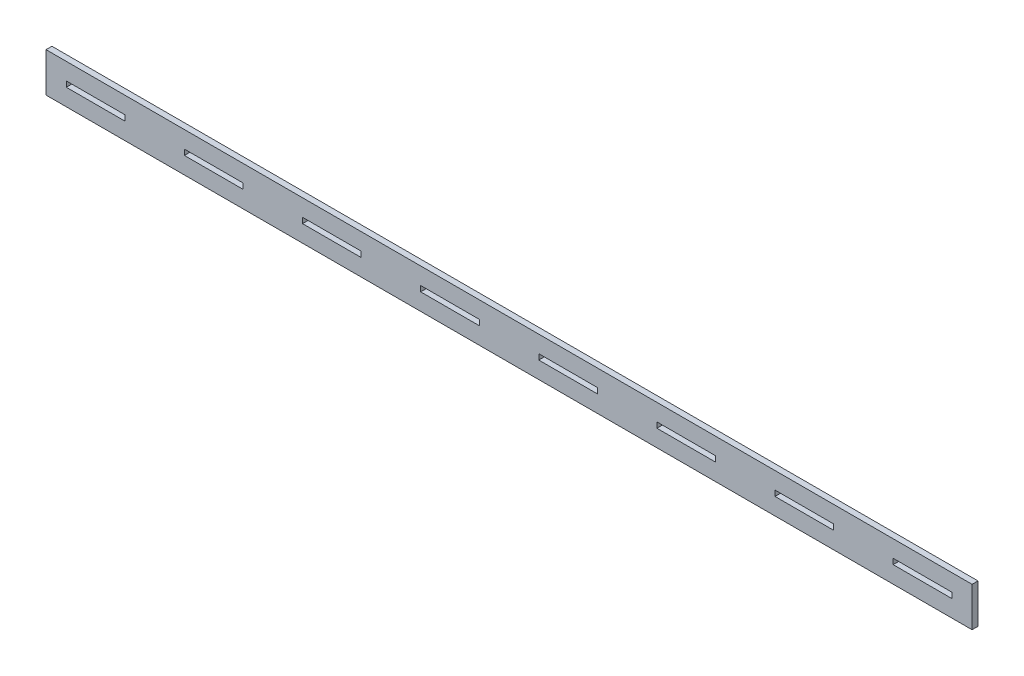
ISO-10303-21;
HEADER;
FILE_DESCRIPTION(('STEP AP214'),'2;1');
FILE_NAME('part.step','',(''),(''),'','','');
FILE_SCHEMA(('AUTOMOTIVE_DESIGN { 1 0 10303 214 1 1 1 1 }'));
ENDSEC;
DATA;
#1=APPLICATION_CONTEXT('core data for automotive mechanical design processes');
#2=APPLICATION_PROTOCOL_DEFINITION('international standard','automotive_design',2000,#1);
#3=PRODUCT_CONTEXT('',#1,'mechanical');
#4=PRODUCT('Part','Part','',(#3));
#5=PRODUCT_RELATED_PRODUCT_CATEGORY('part','',(#4));
#6=PRODUCT_DEFINITION_FORMATION('','',#4);
#7=PRODUCT_DEFINITION_CONTEXT('part definition',#1,'design');
#8=PRODUCT_DEFINITION('design','',#6,#7);
#9=PRODUCT_DEFINITION_SHAPE('','',#8);
#10=(LENGTH_UNIT() NAMED_UNIT(*) SI_UNIT(.MILLI.,.METRE.));
#11=(NAMED_UNIT(*) PLANE_ANGLE_UNIT() SI_UNIT($,.RADIAN.));
#12=(NAMED_UNIT(*) SI_UNIT($,.STERADIAN.) SOLID_ANGLE_UNIT());
#13=UNCERTAINTY_MEASURE_WITH_UNIT(LENGTH_MEASURE(1.E-05),#10,'distance_accuracy_value','');
#14=(GEOMETRIC_REPRESENTATION_CONTEXT(3) GLOBAL_UNCERTAINTY_ASSIGNED_CONTEXT((#13)) GLOBAL_UNIT_ASSIGNED_CONTEXT((#10,
#11,#12)) REPRESENTATION_CONTEXT('',''));
#15=CARTESIAN_POINT('',(0.,0.,0.));
#16=DIRECTION('',(0.,0.,1.));
#17=DIRECTION('',(1.,0.,0.));
#18=AXIS2_PLACEMENT_3D('',#15,#16,#17);
#19=CARTESIAN_POINT('',(0.,0.,3.));
#20=DIRECTION('',(0.,0.,-1.));
#21=DIRECTION('',(-1.,0.,0.));
#22=AXIS2_PLACEMENT_3D('',#19,#20,#21);
#23=PLANE('',#22);
#24=DIRECTION('',(0.,1.,0.));
#25=VECTOR('',#24,1.);
#26=CARTESIAN_POINT('',(164.9,-1.4,3.));
#27=LINE('',#26,#25);
#28=CARTESIAN_POINT('',(164.9,-1.4,3.));
#29=VERTEX_POINT('',#28);
#30=CARTESIAN_POINT('',(164.9,1.4,3.));
#31=VERTEX_POINT('',#30);
#32=EDGE_CURVE('E301',#29,#31,#27,.T.);
#33=ORIENTED_EDGE('',*,*,#32,.F.);
#34=DIRECTION('',(1.,0.,0.));
#35=VECTOR('',#34,1.);
#36=CARTESIAN_POINT('',(135.1,-1.4,3.));
#37=LINE('',#36,#35);
#38=CARTESIAN_POINT('',(135.1,-1.4,3.));
#39=VERTEX_POINT('',#38);
#40=EDGE_CURVE('E309',#39,#29,#37,.T.);
#41=ORIENTED_EDGE('',*,*,#40,.F.);
#42=DIRECTION('',(0.,-1.,0.));
#43=VECTOR('',#42,1.);
#44=CARTESIAN_POINT('',(135.1,-1.4,3.));
#45=LINE('',#44,#43);
#46=CARTESIAN_POINT('',(135.1,1.4,3.));
#47=VERTEX_POINT('',#46);
#48=EDGE_CURVE('E306',#47,#39,#45,.T.);
#49=ORIENTED_EDGE('',*,*,#48,.F.);
#50=DIRECTION('',(-1.,0.,0.));
#51=VECTOR('',#50,1.);
#52=CARTESIAN_POINT('',(135.1,1.4,3.));
#53=LINE('',#52,#51);
#54=EDGE_CURVE('E303',#31,#47,#53,.T.);
#55=ORIENTED_EDGE('',*,*,#54,.F.);
#56=EDGE_LOOP('',(#33,#41,#49,#55));
#57=FACE_BOUND('',#56,.T.);
#58=DIRECTION('',(0.,1.,0.));
#59=VECTOR('',#58,1.);
#60=CARTESIAN_POINT('',(44.9,-1.40000000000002,3.));
#61=LINE('',#60,#59);
#62=CARTESIAN_POINT('',(44.9,-1.40000000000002,3.));
#63=VERTEX_POINT('',#62);
#64=CARTESIAN_POINT('',(44.9,1.40000000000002,3.));
#65=VERTEX_POINT('',#64);
#66=EDGE_CURVE('E363',#63,#65,#61,.T.);
#67=ORIENTED_EDGE('',*,*,#66,.F.);
#68=DIRECTION('',(1.,0.,0.));
#69=VECTOR('',#68,1.);
#70=CARTESIAN_POINT('',(15.1,-1.40000000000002,3.));
#71=LINE('',#70,#69);
#72=CARTESIAN_POINT('',(15.1,-1.40000000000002,3.));
#73=VERTEX_POINT('',#72);
#74=EDGE_CURVE('E371',#73,#63,#71,.T.);
#75=ORIENTED_EDGE('',*,*,#74,.F.);
#76=DIRECTION('',(0.,-1.,0.));
#77=VECTOR('',#76,1.);
#78=CARTESIAN_POINT('',(15.1,-1.40000000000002,3.));
#79=LINE('',#78,#77);
#80=CARTESIAN_POINT('',(15.1,1.40000000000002,3.));
#81=VERTEX_POINT('',#80);
#82=EDGE_CURVE('E368',#81,#73,#79,.T.);
#83=ORIENTED_EDGE('',*,*,#82,.F.);
#84=DIRECTION('',(-1.,0.,0.));
#85=VECTOR('',#84,1.);
#86=CARTESIAN_POINT('',(15.1,1.40000000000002,3.));
#87=LINE('',#86,#85);
#88=EDGE_CURVE('E365',#65,#81,#87,.T.);
#89=ORIENTED_EDGE('',*,*,#88,.F.);
#90=EDGE_LOOP('',(#67,#75,#83,#89));
#91=FACE_BOUND('',#90,.T.);
#92=DIRECTION('',(0.,1.,0.));
#93=VECTOR('',#92,1.);
#94=CARTESIAN_POINT('',(-75.1,-1.4,3.));
#95=LINE('',#94,#93);
#96=CARTESIAN_POINT('',(-75.1,-1.4,3.));
#97=VERTEX_POINT('',#96);
#98=CARTESIAN_POINT('',(-75.1,1.4,3.));
#99=VERTEX_POINT('',#98);
#100=EDGE_CURVE('E425',#97,#99,#95,.T.);
#101=ORIENTED_EDGE('',*,*,#100,.F.);
#102=DIRECTION('',(1.,0.,0.));
#103=VECTOR('',#102,1.);
#104=CARTESIAN_POINT('',(-104.9,-1.4,3.));
#105=LINE('',#104,#103);
#106=CARTESIAN_POINT('',(-104.9,-1.4,3.));
#107=VERTEX_POINT('',#106);
#108=EDGE_CURVE('E433',#107,#97,#105,.T.);
#109=ORIENTED_EDGE('',*,*,#108,.F.);
#110=DIRECTION('',(0.,-1.,0.));
#111=VECTOR('',#110,1.);
#112=CARTESIAN_POINT('',(-104.9,-1.4,3.));
#113=LINE('',#112,#111);
#114=CARTESIAN_POINT('',(-104.9,1.4,3.));
#115=VERTEX_POINT('',#114);
#116=EDGE_CURVE('E430',#115,#107,#113,.T.);
#117=ORIENTED_EDGE('',*,*,#116,.F.);
#118=DIRECTION('',(-1.,0.,0.));
#119=VECTOR('',#118,1.);
#120=CARTESIAN_POINT('',(-104.9,1.4,3.));
#121=LINE('',#120,#119);
#122=EDGE_CURVE('E427',#99,#115,#121,.T.);
#123=ORIENTED_EDGE('',*,*,#122,.F.);
#124=EDGE_LOOP('',(#101,#109,#117,#123));
#125=FACE_BOUND('',#124,.T.);
#126=DIRECTION('',(0.,1.,0.));
#127=VECTOR('',#126,1.);
#128=CARTESIAN_POINT('',(-195.1,-1.4,3.));
#129=LINE('',#128,#127);
#130=CARTESIAN_POINT('',(-195.1,-1.4,3.));
#131=VERTEX_POINT('',#130);
#132=CARTESIAN_POINT('',(-195.1,1.4,3.));
#133=VERTEX_POINT('',#132);
#134=EDGE_CURVE('E487',#131,#133,#129,.T.);
#135=ORIENTED_EDGE('',*,*,#134,.F.);
#136=DIRECTION('',(1.,0.,0.));
#137=VECTOR('',#136,1.);
#138=CARTESIAN_POINT('',(-224.9,-1.4,3.));
#139=LINE('',#138,#137);
#140=CARTESIAN_POINT('',(-224.9,-1.4,3.));
#141=VERTEX_POINT('',#140);
#142=EDGE_CURVE('E495',#141,#131,#139,.T.);
#143=ORIENTED_EDGE('',*,*,#142,.F.);
#144=DIRECTION('',(0.,-1.,0.));
#145=VECTOR('',#144,1.);
#146=CARTESIAN_POINT('',(-224.9,-1.4,3.));
#147=LINE('',#146,#145);
#148=CARTESIAN_POINT('',(-224.9,1.4,3.));
#149=VERTEX_POINT('',#148);
#150=EDGE_CURVE('E492',#149,#141,#147,.T.);
#151=ORIENTED_EDGE('',*,*,#150,.F.);
#152=DIRECTION('',(-1.,0.,0.));
#153=VECTOR('',#152,1.);
#154=CARTESIAN_POINT('',(-224.9,1.4,3.));
#155=LINE('',#154,#153);
#156=EDGE_CURVE('E489',#133,#149,#155,.T.);
#157=ORIENTED_EDGE('',*,*,#156,.F.);
#158=EDGE_LOOP('',(#135,#143,#151,#157));
#159=FACE_BOUND('',#158,.T.);
#160=DIRECTION('',(0.,1.,0.));
#161=VECTOR('',#160,1.);
#162=CARTESIAN_POINT('',(235.2,-10.,3.));
#163=LINE('',#162,#161);
#164=CARTESIAN_POINT('',(235.2,-10.,3.));
#165=VERTEX_POINT('',#164);
#166=CARTESIAN_POINT('',(235.2,10.,3.));
#167=VERTEX_POINT('',#166);
#168=EDGE_CURVE('E518',#165,#167,#163,.T.);
#169=ORIENTED_EDGE('',*,*,#168,.T.);
#170=DIRECTION('',(-1.,0.,0.));
#171=VECTOR('',#170,1.);
#172=CARTESIAN_POINT('',(-235.2,10.,3.));
#173=LINE('',#172,#171);
#174=CARTESIAN_POINT('',(-235.2,10.,3.));
#175=VERTEX_POINT('',#174);
#176=EDGE_CURVE('E521',#167,#175,#173,.T.);
#177=ORIENTED_EDGE('',*,*,#176,.T.);
#178=DIRECTION('',(0.,-1.,0.));
#179=VECTOR('',#178,1.);
#180=CARTESIAN_POINT('',(-235.2,-10.,3.));
#181=LINE('',#180,#179);
#182=CARTESIAN_POINT('',(-235.2,-10.,3.));
#183=VERTEX_POINT('',#182);
#184=EDGE_CURVE('E524',#175,#183,#181,.T.);
#185=ORIENTED_EDGE('',*,*,#184,.T.);
#186=DIRECTION('',(1.,0.,0.));
#187=VECTOR('',#186,1.);
#188=CARTESIAN_POINT('',(-235.2,-10.,3.));
#189=LINE('',#188,#187);
#190=EDGE_CURVE('E526',#183,#165,#189,.T.);
#191=ORIENTED_EDGE('',*,*,#190,.T.);
#192=EDGE_LOOP('',(#169,#177,#185,#191));
#193=FACE_BOUND('',#192,.T.);
#194=DIRECTION('',(0.,1.,0.));
#195=VECTOR('',#194,1.);
#196=CARTESIAN_POINT('',(-15.1,-1.4,3.));
#197=LINE('',#196,#195);
#198=CARTESIAN_POINT('',(-15.1,-1.4,3.));
#199=VERTEX_POINT('',#198);
#200=CARTESIAN_POINT('',(-15.1,1.4,3.));
#201=VERTEX_POINT('',#200);
#202=EDGE_CURVE('E456',#199,#201,#197,.T.);
#203=ORIENTED_EDGE('',*,*,#202,.F.);
#204=DIRECTION('',(1.,0.,0.));
#205=VECTOR('',#204,1.);
#206=CARTESIAN_POINT('',(-44.9,-1.4,3.));
#207=LINE('',#206,#205);
#208=CARTESIAN_POINT('',(-44.9,-1.4,3.));
#209=VERTEX_POINT('',#208);
#210=EDGE_CURVE('E464',#209,#199,#207,.T.);
#211=ORIENTED_EDGE('',*,*,#210,.F.);
#212=DIRECTION('',(0.,-1.,0.));
#213=VECTOR('',#212,1.);
#214=CARTESIAN_POINT('',(-44.9,-1.4,3.));
#215=LINE('',#214,#213);
#216=CARTESIAN_POINT('',(-44.9,1.4,3.));
#217=VERTEX_POINT('',#216);
#218=EDGE_CURVE('E461',#217,#209,#215,.T.);
#219=ORIENTED_EDGE('',*,*,#218,.F.);
#220=DIRECTION('',(-1.,0.,0.));
#221=VECTOR('',#220,1.);
#222=CARTESIAN_POINT('',(-44.9,1.4,3.));
#223=LINE('',#222,#221);
#224=EDGE_CURVE('E458',#201,#217,#223,.T.);
#225=ORIENTED_EDGE('',*,*,#224,.F.);
#226=EDGE_LOOP('',(#203,#211,#219,#225));
#227=FACE_BOUND('',#226,.T.);
#228=DIRECTION('',(0.,1.,0.));
#229=VECTOR('',#228,1.);
#230=CARTESIAN_POINT('',(-135.1,-1.4,3.));
#231=LINE('',#230,#229);
#232=CARTESIAN_POINT('',(-135.1,-1.4,3.));
#233=VERTEX_POINT('',#232);
#234=CARTESIAN_POINT('',(-135.1,1.4,3.));
#235=VERTEX_POINT('',#234);
#236=EDGE_CURVE('E394',#233,#235,#231,.T.);
#237=ORIENTED_EDGE('',*,*,#236,.F.);
#238=DIRECTION('',(1.,0.,0.));
#239=VECTOR('',#238,1.);
#240=CARTESIAN_POINT('',(-164.9,-1.4,3.));
#241=LINE('',#240,#239);
#242=CARTESIAN_POINT('',(-164.9,-1.4,3.));
#243=VERTEX_POINT('',#242);
#244=EDGE_CURVE('E402',#243,#233,#241,.T.);
#245=ORIENTED_EDGE('',*,*,#244,.F.);
#246=DIRECTION('',(0.,-1.,0.));
#247=VECTOR('',#246,1.);
#248=CARTESIAN_POINT('',(-164.9,-1.4,3.));
#249=LINE('',#248,#247);
#250=CARTESIAN_POINT('',(-164.9,1.4,3.));
#251=VERTEX_POINT('',#250);
#252=EDGE_CURVE('E399',#251,#243,#249,.T.);
#253=ORIENTED_EDGE('',*,*,#252,.F.);
#254=DIRECTION('',(-1.,0.,0.));
#255=VECTOR('',#254,1.);
#256=CARTESIAN_POINT('',(-164.9,1.4,3.));
#257=LINE('',#256,#255);
#258=EDGE_CURVE('E396',#235,#251,#257,.T.);
#259=ORIENTED_EDGE('',*,*,#258,.F.);
#260=EDGE_LOOP('',(#237,#245,#253,#259));
#261=FACE_BOUND('',#260,.T.);
#262=DIRECTION('',(0.,1.,0.));
#263=VECTOR('',#262,1.);
#264=CARTESIAN_POINT('',(104.9,-1.40000000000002,3.));
#265=LINE('',#264,#263);
#266=CARTESIAN_POINT('',(104.9,-1.40000000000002,3.));
#267=VERTEX_POINT('',#266);
#268=CARTESIAN_POINT('',(104.9,1.40000000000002,3.));
#269=VERTEX_POINT('',#268);
#270=EDGE_CURVE('E332',#267,#269,#265,.T.);
#271=ORIENTED_EDGE('',*,*,#270,.F.);
#272=DIRECTION('',(1.,0.,0.));
#273=VECTOR('',#272,1.);
#274=CARTESIAN_POINT('',(75.1,-1.40000000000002,3.));
#275=LINE('',#274,#273);
#276=CARTESIAN_POINT('',(75.1,-1.40000000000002,3.));
#277=VERTEX_POINT('',#276);
#278=EDGE_CURVE('E340',#277,#267,#275,.T.);
#279=ORIENTED_EDGE('',*,*,#278,.F.);
#280=DIRECTION('',(0.,-1.,0.));
#281=VECTOR('',#280,1.);
#282=CARTESIAN_POINT('',(75.1,-1.40000000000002,3.));
#283=LINE('',#282,#281);
#284=CARTESIAN_POINT('',(75.1,1.40000000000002,3.));
#285=VERTEX_POINT('',#284);
#286=EDGE_CURVE('E337',#285,#277,#283,.T.);
#287=ORIENTED_EDGE('',*,*,#286,.F.);
#288=DIRECTION('',(-1.,0.,0.));
#289=VECTOR('',#288,1.);
#290=CARTESIAN_POINT('',(75.1,1.40000000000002,3.));
#291=LINE('',#290,#289);
#292=EDGE_CURVE('E334',#269,#285,#291,.T.);
#293=ORIENTED_EDGE('',*,*,#292,.F.);
#294=EDGE_LOOP('',(#271,#279,#287,#293));
#295=FACE_BOUND('',#294,.T.);
#296=DIRECTION('',(0.,1.,0.));
#297=VECTOR('',#296,1.);
#298=CARTESIAN_POINT('',(224.9,-1.4,3.));
#299=LINE('',#298,#297);
#300=CARTESIAN_POINT('',(224.9,-1.4,3.));
#301=VERTEX_POINT('',#300);
#302=CARTESIAN_POINT('',(224.9,1.4,3.));
#303=VERTEX_POINT('',#302);
#304=EDGE_CURVE('E265',#301,#303,#299,.T.);
#305=ORIENTED_EDGE('',*,*,#304,.F.);
#306=DIRECTION('',(1.,0.,0.));
#307=VECTOR('',#306,1.);
#308=CARTESIAN_POINT('',(195.1,-1.4,3.));
#309=LINE('',#308,#307);
#310=CARTESIAN_POINT('',(195.1,-1.4,3.));
#311=VERTEX_POINT('',#310);
#312=EDGE_CURVE('E287',#311,#301,#309,.T.);
#313=ORIENTED_EDGE('',*,*,#312,.F.);
#314=DIRECTION('',(0.,-1.,0.));
#315=VECTOR('',#314,1.);
#316=CARTESIAN_POINT('',(195.1,-1.4,3.));
#317=LINE('',#316,#315);
#318=CARTESIAN_POINT('',(195.1,1.4,3.));
#319=VERTEX_POINT('',#318);
#320=EDGE_CURVE('E285',#319,#311,#317,.T.);
#321=ORIENTED_EDGE('',*,*,#320,.F.);
#322=DIRECTION('',(-1.,0.,0.));
#323=VECTOR('',#322,1.);
#324=CARTESIAN_POINT('',(195.1,1.4,3.));
#325=LINE('',#324,#323);
#326=EDGE_CURVE('E273',#303,#319,#325,.T.);
#327=ORIENTED_EDGE('',*,*,#326,.F.);
#328=EDGE_LOOP('',(#305,#313,#321,#327));
#329=FACE_BOUND('',#328,.T.);
#330=ADVANCED_FACE('F32',(#57,#91,#125,#159,#193,#227,#261,#295,#329),#23,.F.);
#331=CARTESIAN_POINT('',(0.,0.,0.));
#332=DIRECTION('',(0.,0.,-1.));
#333=DIRECTION('',(-1.,0.,0.));
#334=AXIS2_PLACEMENT_3D('',#331,#332,#333);
#335=PLANE('',#334);
#336=DIRECTION('',(0.,1.,0.));
#337=VECTOR('',#336,1.);
#338=CARTESIAN_POINT('',(235.2,-10.,0.));
#339=LINE('',#338,#337);
#340=CARTESIAN_POINT('',(235.2,-10.,0.));
#341=VERTEX_POINT('',#340);
#342=CARTESIAN_POINT('',(235.2,10.,0.));
#343=VERTEX_POINT('',#342);
#344=EDGE_CURVE('E517',#341,#343,#339,.T.);
#345=ORIENTED_EDGE('',*,*,#344,.F.);
#346=DIRECTION('',(1.,0.,0.));
#347=VECTOR('',#346,1.);
#348=CARTESIAN_POINT('',(-235.2,-10.,0.));
#349=LINE('',#348,#347);
#350=CARTESIAN_POINT('',(-235.2,-10.,0.));
#351=VERTEX_POINT('',#350);
#352=EDGE_CURVE('E522',#351,#341,#349,.T.);
#353=ORIENTED_EDGE('',*,*,#352,.F.);
#354=DIRECTION('',(0.,-1.,0.));
#355=VECTOR('',#354,1.);
#356=CARTESIAN_POINT('',(-235.2,-10.,0.));
#357=LINE('',#356,#355);
#358=CARTESIAN_POINT('',(-235.2,10.,0.));
#359=VERTEX_POINT('',#358);
#360=EDGE_CURVE('E533',#359,#351,#357,.T.);
#361=ORIENTED_EDGE('',*,*,#360,.F.);
#362=DIRECTION('',(-1.,0.,0.));
#363=VECTOR('',#362,1.);
#364=CARTESIAN_POINT('',(-235.2,10.,0.));
#365=LINE('',#364,#363);
#366=EDGE_CURVE('E531',#343,#359,#365,.T.);
#367=ORIENTED_EDGE('',*,*,#366,.F.);
#368=EDGE_LOOP('',(#345,#353,#361,#367));
#369=FACE_BOUND('',#368,.T.);
#370=DIRECTION('',(1.,0.,0.));
#371=VECTOR('',#370,1.);
#372=CARTESIAN_POINT('',(-224.9,-1.4,0.));
#373=LINE('',#372,#371);
#374=CARTESIAN_POINT('',(-224.9,-1.4,0.));
#375=VERTEX_POINT('',#374);
#376=CARTESIAN_POINT('',(-195.1,-1.4,0.));
#377=VERTEX_POINT('',#376);
#378=EDGE_CURVE('E490',#375,#377,#373,.T.);
#379=ORIENTED_EDGE('',*,*,#378,.T.);
#380=DIRECTION('',(0.,1.,0.));
#381=VECTOR('',#380,1.);
#382=CARTESIAN_POINT('',(-195.1,-1.4,0.));
#383=LINE('',#382,#381);
#384=CARTESIAN_POINT('',(-195.1,1.4,0.));
#385=VERTEX_POINT('',#384);
#386=EDGE_CURVE('E486',#377,#385,#383,.T.);
#387=ORIENTED_EDGE('',*,*,#386,.T.);
#388=DIRECTION('',(-1.,0.,0.));
#389=VECTOR('',#388,1.);
#390=CARTESIAN_POINT('',(-224.9,1.4,0.));
#391=LINE('',#390,#389);
#392=CARTESIAN_POINT('',(-224.9,1.4,0.));
#393=VERTEX_POINT('',#392);
#394=EDGE_CURVE('E500',#385,#393,#391,.T.);
#395=ORIENTED_EDGE('',*,*,#394,.T.);
#396=DIRECTION('',(0.,-1.,0.));
#397=VECTOR('',#396,1.);
#398=CARTESIAN_POINT('',(-224.9,-1.4,0.));
#399=LINE('',#398,#397);
#400=EDGE_CURVE('E503',#393,#375,#399,.T.);
#401=ORIENTED_EDGE('',*,*,#400,.T.);
#402=EDGE_LOOP('',(#379,#387,#395,#401));
#403=FACE_BOUND('',#402,.T.);
#404=DIRECTION('',(1.,0.,0.));
#405=VECTOR('',#404,1.);
#406=CARTESIAN_POINT('',(-44.9,-1.4,0.));
#407=LINE('',#406,#405);
#408=CARTESIAN_POINT('',(-44.9,-1.4,0.));
#409=VERTEX_POINT('',#408);
#410=CARTESIAN_POINT('',(-15.1,-1.4,0.));
#411=VERTEX_POINT('',#410);
#412=EDGE_CURVE('E459',#409,#411,#407,.T.);
#413=ORIENTED_EDGE('',*,*,#412,.T.);
#414=DIRECTION('',(0.,1.,0.));
#415=VECTOR('',#414,1.);
#416=CARTESIAN_POINT('',(-15.1,-1.4,0.));
#417=LINE('',#416,#415);
#418=CARTESIAN_POINT('',(-15.1,1.4,0.));
#419=VERTEX_POINT('',#418);
#420=EDGE_CURVE('E455',#411,#419,#417,.T.);
#421=ORIENTED_EDGE('',*,*,#420,.T.);
#422=DIRECTION('',(-1.,0.,0.));
#423=VECTOR('',#422,1.);
#424=CARTESIAN_POINT('',(-44.9,1.4,0.));
#425=LINE('',#424,#423);
#426=CARTESIAN_POINT('',(-44.9,1.4,0.));
#427=VERTEX_POINT('',#426);
#428=EDGE_CURVE('E469',#419,#427,#425,.T.);
#429=ORIENTED_EDGE('',*,*,#428,.T.);
#430=DIRECTION('',(0.,-1.,0.));
#431=VECTOR('',#430,1.);
#432=CARTESIAN_POINT('',(-44.9,-1.4,0.));
#433=LINE('',#432,#431);
#434=EDGE_CURVE('E472',#427,#409,#433,.T.);
#435=ORIENTED_EDGE('',*,*,#434,.T.);
#436=EDGE_LOOP('',(#413,#421,#429,#435));
#437=FACE_BOUND('',#436,.T.);
#438=DIRECTION('',(1.,0.,0.));
#439=VECTOR('',#438,1.);
#440=CARTESIAN_POINT('',(-104.9,-1.4,0.));
#441=LINE('',#440,#439);
#442=CARTESIAN_POINT('',(-104.9,-1.4,0.));
#443=VERTEX_POINT('',#442);
#444=CARTESIAN_POINT('',(-75.1,-1.4,0.));
#445=VERTEX_POINT('',#444);
#446=EDGE_CURVE('E428',#443,#445,#441,.T.);
#447=ORIENTED_EDGE('',*,*,#446,.T.);
#448=DIRECTION('',(0.,1.,0.));
#449=VECTOR('',#448,1.);
#450=CARTESIAN_POINT('',(-75.1,-1.4,0.));
#451=LINE('',#450,#449);
#452=CARTESIAN_POINT('',(-75.1,1.4,0.));
#453=VERTEX_POINT('',#452);
#454=EDGE_CURVE('E424',#445,#453,#451,.T.);
#455=ORIENTED_EDGE('',*,*,#454,.T.);
#456=DIRECTION('',(-1.,0.,0.));
#457=VECTOR('',#456,1.);
#458=CARTESIAN_POINT('',(-104.9,1.4,0.));
#459=LINE('',#458,#457);
#460=CARTESIAN_POINT('',(-104.9,1.4,0.));
#461=VERTEX_POINT('',#460);
#462=EDGE_CURVE('E438',#453,#461,#459,.T.);
#463=ORIENTED_EDGE('',*,*,#462,.T.);
#464=DIRECTION('',(0.,-1.,0.));
#465=VECTOR('',#464,1.);
#466=CARTESIAN_POINT('',(-104.9,-1.4,0.));
#467=LINE('',#466,#465);
#468=EDGE_CURVE('E441',#461,#443,#467,.T.);
#469=ORIENTED_EDGE('',*,*,#468,.T.);
#470=EDGE_LOOP('',(#447,#455,#463,#469));
#471=FACE_BOUND('',#470,.T.);
#472=DIRECTION('',(1.,0.,0.));
#473=VECTOR('',#472,1.);
#474=CARTESIAN_POINT('',(-164.9,-1.4,0.));
#475=LINE('',#474,#473);
#476=CARTESIAN_POINT('',(-164.9,-1.4,0.));
#477=VERTEX_POINT('',#476);
#478=CARTESIAN_POINT('',(-135.1,-1.4,0.));
#479=VERTEX_POINT('',#478);
#480=EDGE_CURVE('E397',#477,#479,#475,.T.);
#481=ORIENTED_EDGE('',*,*,#480,.T.);
#482=DIRECTION('',(0.,1.,0.));
#483=VECTOR('',#482,1.);
#484=CARTESIAN_POINT('',(-135.1,-1.4,0.));
#485=LINE('',#484,#483);
#486=CARTESIAN_POINT('',(-135.1,1.4,0.));
#487=VERTEX_POINT('',#486);
#488=EDGE_CURVE('E393',#479,#487,#485,.T.);
#489=ORIENTED_EDGE('',*,*,#488,.T.);
#490=DIRECTION('',(-1.,0.,0.));
#491=VECTOR('',#490,1.);
#492=CARTESIAN_POINT('',(-164.9,1.4,0.));
#493=LINE('',#492,#491);
#494=CARTESIAN_POINT('',(-164.9,1.4,0.));
#495=VERTEX_POINT('',#494);
#496=EDGE_CURVE('E407',#487,#495,#493,.T.);
#497=ORIENTED_EDGE('',*,*,#496,.T.);
#498=DIRECTION('',(0.,-1.,0.));
#499=VECTOR('',#498,1.);
#500=CARTESIAN_POINT('',(-164.9,-1.4,0.));
#501=LINE('',#500,#499);
#502=EDGE_CURVE('E410',#495,#477,#501,.T.);
#503=ORIENTED_EDGE('',*,*,#502,.T.);
#504=EDGE_LOOP('',(#481,#489,#497,#503));
#505=FACE_BOUND('',#504,.T.);
#506=DIRECTION('',(1.,0.,0.));
#507=VECTOR('',#506,1.);
#508=CARTESIAN_POINT('',(15.1,-1.40000000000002,0.));
#509=LINE('',#508,#507);
#510=CARTESIAN_POINT('',(15.1,-1.40000000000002,0.));
#511=VERTEX_POINT('',#510);
#512=CARTESIAN_POINT('',(44.9,-1.40000000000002,0.));
#513=VERTEX_POINT('',#512);
#514=EDGE_CURVE('E366',#511,#513,#509,.T.);
#515=ORIENTED_EDGE('',*,*,#514,.T.);
#516=DIRECTION('',(0.,1.,0.));
#517=VECTOR('',#516,1.);
#518=CARTESIAN_POINT('',(44.9,-1.40000000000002,0.));
#519=LINE('',#518,#517);
#520=CARTESIAN_POINT('',(44.9,1.40000000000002,0.));
#521=VERTEX_POINT('',#520);
#522=EDGE_CURVE('E362',#513,#521,#519,.T.);
#523=ORIENTED_EDGE('',*,*,#522,.T.);
#524=DIRECTION('',(-1.,0.,0.));
#525=VECTOR('',#524,1.);
#526=CARTESIAN_POINT('',(15.1,1.40000000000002,0.));
#527=LINE('',#526,#525);
#528=CARTESIAN_POINT('',(15.1,1.40000000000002,0.));
#529=VERTEX_POINT('',#528);
#530=EDGE_CURVE('E376',#521,#529,#527,.T.);
#531=ORIENTED_EDGE('',*,*,#530,.T.);
#532=DIRECTION('',(0.,-1.,0.));
#533=VECTOR('',#532,1.);
#534=CARTESIAN_POINT('',(15.1,-1.40000000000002,0.));
#535=LINE('',#534,#533);
#536=EDGE_CURVE('E379',#529,#511,#535,.T.);
#537=ORIENTED_EDGE('',*,*,#536,.T.);
#538=EDGE_LOOP('',(#515,#523,#531,#537));
#539=FACE_BOUND('',#538,.T.);
#540=DIRECTION('',(1.,0.,0.));
#541=VECTOR('',#540,1.);
#542=CARTESIAN_POINT('',(75.1,-1.40000000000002,0.));
#543=LINE('',#542,#541);
#544=CARTESIAN_POINT('',(75.1,-1.40000000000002,0.));
#545=VERTEX_POINT('',#544);
#546=CARTESIAN_POINT('',(104.9,-1.40000000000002,0.));
#547=VERTEX_POINT('',#546);
#548=EDGE_CURVE('E335',#545,#547,#543,.T.);
#549=ORIENTED_EDGE('',*,*,#548,.T.);
#550=DIRECTION('',(0.,1.,0.));
#551=VECTOR('',#550,1.);
#552=CARTESIAN_POINT('',(104.9,-1.40000000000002,0.));
#553=LINE('',#552,#551);
#554=CARTESIAN_POINT('',(104.9,1.40000000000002,0.));
#555=VERTEX_POINT('',#554);
#556=EDGE_CURVE('E331',#547,#555,#553,.T.);
#557=ORIENTED_EDGE('',*,*,#556,.T.);
#558=DIRECTION('',(-1.,0.,0.));
#559=VECTOR('',#558,1.);
#560=CARTESIAN_POINT('',(75.1,1.40000000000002,0.));
#561=LINE('',#560,#559);
#562=CARTESIAN_POINT('',(75.1,1.40000000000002,0.));
#563=VERTEX_POINT('',#562);
#564=EDGE_CURVE('E345',#555,#563,#561,.T.);
#565=ORIENTED_EDGE('',*,*,#564,.T.);
#566=DIRECTION('',(0.,-1.,0.));
#567=VECTOR('',#566,1.);
#568=CARTESIAN_POINT('',(75.1,-1.40000000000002,0.));
#569=LINE('',#568,#567);
#570=EDGE_CURVE('E348',#563,#545,#569,.T.);
#571=ORIENTED_EDGE('',*,*,#570,.T.);
#572=EDGE_LOOP('',(#549,#557,#565,#571));
#573=FACE_BOUND('',#572,.T.);
#574=DIRECTION('',(1.,0.,0.));
#575=VECTOR('',#574,1.);
#576=CARTESIAN_POINT('',(135.1,-1.4,0.));
#577=LINE('',#576,#575);
#578=CARTESIAN_POINT('',(135.1,-1.4,0.));
#579=VERTEX_POINT('',#578);
#580=CARTESIAN_POINT('',(164.9,-1.4,0.));
#581=VERTEX_POINT('',#580);
#582=EDGE_CURVE('E304',#579,#581,#577,.T.);
#583=ORIENTED_EDGE('',*,*,#582,.T.);
#584=DIRECTION('',(0.,1.,0.));
#585=VECTOR('',#584,1.);
#586=CARTESIAN_POINT('',(164.9,-1.4,0.));
#587=LINE('',#586,#585);
#588=CARTESIAN_POINT('',(164.9,1.4,0.));
#589=VERTEX_POINT('',#588);
#590=EDGE_CURVE('E281',#581,#589,#587,.T.);
#591=ORIENTED_EDGE('',*,*,#590,.T.);
#592=DIRECTION('',(-1.,0.,0.));
#593=VECTOR('',#592,1.);
#594=CARTESIAN_POINT('',(135.1,1.4,0.));
#595=LINE('',#594,#593);
#596=CARTESIAN_POINT('',(135.1,1.4,0.));
#597=VERTEX_POINT('',#596);
#598=EDGE_CURVE('E314',#589,#597,#595,.T.);
#599=ORIENTED_EDGE('',*,*,#598,.T.);
#600=DIRECTION('',(0.,-1.,0.));
#601=VECTOR('',#600,1.);
#602=CARTESIAN_POINT('',(135.1,-1.4,0.));
#603=LINE('',#602,#601);
#604=EDGE_CURVE('E317',#597,#579,#603,.T.);
#605=ORIENTED_EDGE('',*,*,#604,.T.);
#606=EDGE_LOOP('',(#583,#591,#599,#605));
#607=FACE_BOUND('',#606,.T.);
#608=DIRECTION('',(1.,0.,0.));
#609=VECTOR('',#608,1.);
#610=CARTESIAN_POINT('',(195.1,-1.4,0.));
#611=LINE('',#610,#609);
#612=CARTESIAN_POINT('',(195.1,-1.4,0.));
#613=VERTEX_POINT('',#612);
#614=CARTESIAN_POINT('',(224.9,-1.4,0.));
#615=VERTEX_POINT('',#614);
#616=EDGE_CURVE('E274',#613,#615,#611,.T.);
#617=ORIENTED_EDGE('',*,*,#616,.T.);
#618=DIRECTION('',(0.,1.,0.));
#619=VECTOR('',#618,1.);
#620=CARTESIAN_POINT('',(224.9,-1.4,0.));
#621=LINE('',#620,#619);
#622=CARTESIAN_POINT('',(224.9,1.4,0.));
#623=VERTEX_POINT('',#622);
#624=EDGE_CURVE('E55',#615,#623,#621,.T.);
#625=ORIENTED_EDGE('',*,*,#624,.T.);
#626=DIRECTION('',(-1.,0.,0.));
#627=VECTOR('',#626,1.);
#628=CARTESIAN_POINT('',(195.1,1.4,0.));
#629=LINE('',#628,#627);
#630=CARTESIAN_POINT('',(195.1,1.4,0.));
#631=VERTEX_POINT('',#630);
#632=EDGE_CURVE('E280',#623,#631,#629,.T.);
#633=ORIENTED_EDGE('',*,*,#632,.T.);
#634=DIRECTION('',(0.,-1.,0.));
#635=VECTOR('',#634,1.);
#636=CARTESIAN_POINT('',(195.1,-1.4,0.));
#637=LINE('',#636,#635);
#638=EDGE_CURVE('E293',#631,#613,#637,.T.);
#639=ORIENTED_EDGE('',*,*,#638,.T.);
#640=EDGE_LOOP('',(#617,#625,#633,#639));
#641=FACE_BOUND('',#640,.T.);
#642=ADVANCED_FACE('F551',(#369,#403,#437,#471,#505,#539,#573,#607,#641),#335,.T.);
#643=CARTESIAN_POINT('',(235.2,-10.,3.));
#644=DIRECTION('',(-1.,0.,0.));
#645=DIRECTION('',(0.,0.,1.));
#646=AXIS2_PLACEMENT_3D('',#643,#644,#645);
#647=PLANE('',#646);
#648=ORIENTED_EDGE('',*,*,#344,.T.);
#649=DIRECTION('',(0.,0.,-1.));
#650=VECTOR('',#649,1.);
#651=CARTESIAN_POINT('',(235.2,10.,3.));
#652=LINE('',#651,#650);
#653=EDGE_CURVE('E11',#167,#343,#652,.T.);
#654=ORIENTED_EDGE('',*,*,#653,.F.);
#655=ORIENTED_EDGE('',*,*,#168,.F.);
#656=DIRECTION('',(0.,0.,-1.));
#657=VECTOR('',#656,1.);
#658=CARTESIAN_POINT('',(235.2,-10.,3.));
#659=LINE('',#658,#657);
#660=EDGE_CURVE('E528',#165,#341,#659,.T.);
#661=ORIENTED_EDGE('',*,*,#660,.T.);
#662=EDGE_LOOP('',(#648,#654,#655,#661));
#663=FACE_BOUND('',#662,.T.);
#664=ADVANCED_FACE('F34',(#663),#647,.F.);
#665=CARTESIAN_POINT('',(-235.2,10.,3.));
#666=DIRECTION('',(0.,-1.,0.));
#667=DIRECTION('',(0.,0.,-1.));
#668=AXIS2_PLACEMENT_3D('',#665,#666,#667);
#669=PLANE('',#668);
#670=ORIENTED_EDGE('',*,*,#366,.T.);
#671=DIRECTION('',(0.,0.,-1.));
#672=VECTOR('',#671,1.);
#673=CARTESIAN_POINT('',(-235.2,10.,3.));
#674=LINE('',#673,#672);
#675=EDGE_CURVE('E40',#175,#359,#674,.T.);
#676=ORIENTED_EDGE('',*,*,#675,.F.);
#677=ORIENTED_EDGE('',*,*,#176,.F.);
#678=ORIENTED_EDGE('',*,*,#653,.T.);
#679=EDGE_LOOP('',(#670,#676,#677,#678));
#680=FACE_BOUND('',#679,.T.);
#681=ADVANCED_FACE('F562',(#680),#669,.F.);
#682=CARTESIAN_POINT('',(-235.2,-10.,3.));
#683=DIRECTION('',(1.,0.,0.));
#684=DIRECTION('',(0.,0.,-1.));
#685=AXIS2_PLACEMENT_3D('',#682,#683,#684);
#686=PLANE('',#685);
#687=ORIENTED_EDGE('',*,*,#360,.T.);
#688=DIRECTION('',(0.,0.,-1.));
#689=VECTOR('',#688,1.);
#690=CARTESIAN_POINT('',(-235.2,-10.,3.));
#691=LINE('',#690,#689);
#692=EDGE_CURVE('E538',#183,#351,#691,.T.);
#693=ORIENTED_EDGE('',*,*,#692,.F.);
#694=ORIENTED_EDGE('',*,*,#184,.F.);
#695=ORIENTED_EDGE('',*,*,#675,.T.);
#696=EDGE_LOOP('',(#687,#693,#694,#695));
#697=FACE_BOUND('',#696,.T.);
#698=ADVANCED_FACE('F545',(#697),#686,.F.);
#699=CARTESIAN_POINT('',(-235.2,-10.,3.));
#700=DIRECTION('',(0.,1.,0.));
#701=DIRECTION('',(0.,0.,1.));
#702=AXIS2_PLACEMENT_3D('',#699,#700,#701);
#703=PLANE('',#702);
#704=ORIENTED_EDGE('',*,*,#352,.T.);
#705=ORIENTED_EDGE('',*,*,#660,.F.);
#706=ORIENTED_EDGE('',*,*,#190,.F.);
#707=ORIENTED_EDGE('',*,*,#692,.T.);
#708=EDGE_LOOP('',(#704,#705,#706,#707));
#709=FACE_BOUND('',#708,.T.);
#710=ADVANCED_FACE('F555',(#709),#703,.F.);
#711=CARTESIAN_POINT('',(-195.1,-1.4,3.));
#712=DIRECTION('',(-1.,0.,0.));
#713=DIRECTION('',(0.,0.,1.));
#714=AXIS2_PLACEMENT_3D('',#711,#712,#713);
#715=PLANE('',#714);
#716=ORIENTED_EDGE('',*,*,#386,.F.);
#717=DIRECTION('',(0.,0.,-1.));
#718=VECTOR('',#717,1.);
#719=CARTESIAN_POINT('',(-195.1,-1.4,3.));
#720=LINE('',#719,#718);
#721=EDGE_CURVE('E497',#131,#377,#720,.T.);
#722=ORIENTED_EDGE('',*,*,#721,.F.);
#723=ORIENTED_EDGE('',*,*,#134,.T.);
#724=DIRECTION('',(0.,0.,-1.));
#725=VECTOR('',#724,1.);
#726=CARTESIAN_POINT('',(-195.1,1.4,3.));
#727=LINE('',#726,#725);
#728=EDGE_CURVE('E514',#133,#385,#727,.T.);
#729=ORIENTED_EDGE('',*,*,#728,.T.);
#730=EDGE_LOOP('',(#716,#722,#723,#729));
#731=FACE_BOUND('',#730,.T.);
#732=ADVANCED_FACE('F579',(#731),#715,.T.);
#733=CARTESIAN_POINT('',(-224.9,1.4,3.));
#734=DIRECTION('',(0.,-1.,0.));
#735=DIRECTION('',(1.,0.,0.));
#736=AXIS2_PLACEMENT_3D('',#733,#734,#735);
#737=PLANE('',#736);
#738=ORIENTED_EDGE('',*,*,#394,.F.);
#739=ORIENTED_EDGE('',*,*,#728,.F.);
#740=ORIENTED_EDGE('',*,*,#156,.T.);
#741=DIRECTION('',(0.,0.,-1.));
#742=VECTOR('',#741,1.);
#743=CARTESIAN_POINT('',(-224.9,1.4,3.));
#744=LINE('',#743,#742);
#745=EDGE_CURVE('E512',#149,#393,#744,.T.);
#746=ORIENTED_EDGE('',*,*,#745,.T.);
#747=EDGE_LOOP('',(#738,#739,#740,#746));
#748=FACE_BOUND('',#747,.T.);
#749=ADVANCED_FACE('F586',(#748),#737,.T.);
#750=CARTESIAN_POINT('',(-224.9,-1.4,3.));
#751=DIRECTION('',(1.,0.,0.));
#752=DIRECTION('',(0.,0.,-1.));
#753=AXIS2_PLACEMENT_3D('',#750,#751,#752);
#754=PLANE('',#753);
#755=ORIENTED_EDGE('',*,*,#400,.F.);
#756=ORIENTED_EDGE('',*,*,#745,.F.);
#757=ORIENTED_EDGE('',*,*,#150,.T.);
#758=DIRECTION('',(0.,0.,-1.));
#759=VECTOR('',#758,1.);
#760=CARTESIAN_POINT('',(-224.9,-1.4,3.));
#761=LINE('',#760,#759);
#762=EDGE_CURVE('E510',#141,#375,#761,.T.);
#763=ORIENTED_EDGE('',*,*,#762,.T.);
#764=EDGE_LOOP('',(#755,#756,#757,#763));
#765=FACE_BOUND('',#764,.T.);
#766=ADVANCED_FACE('F591',(#765),#754,.T.);
#767=CARTESIAN_POINT('',(-224.9,-1.4,3.));
#768=DIRECTION('',(0.,1.,0.));
#769=DIRECTION('',(0.,0.,1.));
#770=AXIS2_PLACEMENT_3D('',#767,#768,#769);
#771=PLANE('',#770);
#772=ORIENTED_EDGE('',*,*,#378,.F.);
#773=ORIENTED_EDGE('',*,*,#762,.F.);
#774=ORIENTED_EDGE('',*,*,#142,.T.);
#775=ORIENTED_EDGE('',*,*,#721,.T.);
#776=EDGE_LOOP('',(#772,#773,#774,#775));
#777=FACE_BOUND('',#776,.T.);
#778=ADVANCED_FACE('F598',(#777),#771,.T.);
#779=CARTESIAN_POINT('',(-15.1,-1.4,3.));
#780=DIRECTION('',(-1.,0.,0.));
#781=DIRECTION('',(0.,0.,1.));
#782=AXIS2_PLACEMENT_3D('',#779,#780,#781);
#783=PLANE('',#782);
#784=ORIENTED_EDGE('',*,*,#420,.F.);
#785=DIRECTION('',(0.,0.,-1.));
#786=VECTOR('',#785,1.);
#787=CARTESIAN_POINT('',(-15.1,-1.4,3.));
#788=LINE('',#787,#786);
#789=EDGE_CURVE('E466',#199,#411,#788,.T.);
#790=ORIENTED_EDGE('',*,*,#789,.F.);
#791=ORIENTED_EDGE('',*,*,#202,.T.);
#792=DIRECTION('',(0.,0.,-1.));
#793=VECTOR('',#792,1.);
#794=CARTESIAN_POINT('',(-15.1,1.4,3.));
#795=LINE('',#794,#793);
#796=EDGE_CURVE('E483',#201,#419,#795,.T.);
#797=ORIENTED_EDGE('',*,*,#796,.T.);
#798=EDGE_LOOP('',(#784,#790,#791,#797));
#799=FACE_BOUND('',#798,.T.);
#800=ADVANCED_FACE('F612',(#799),#783,.T.);
#801=CARTESIAN_POINT('',(-44.9,1.4,3.));
#802=DIRECTION('',(0.,-1.,0.));
#803=DIRECTION('',(0.,0.,-1.));
#804=AXIS2_PLACEMENT_3D('',#801,#802,#803);
#805=PLANE('',#804);
#806=ORIENTED_EDGE('',*,*,#428,.F.);
#807=ORIENTED_EDGE('',*,*,#796,.F.);
#808=ORIENTED_EDGE('',*,*,#224,.T.);
#809=DIRECTION('',(0.,0.,-1.));
#810=VECTOR('',#809,1.);
#811=CARTESIAN_POINT('',(-44.9,1.4,3.));
#812=LINE('',#811,#810);
#813=EDGE_CURVE('E481',#217,#427,#812,.T.);
#814=ORIENTED_EDGE('',*,*,#813,.T.);
#815=EDGE_LOOP('',(#806,#807,#808,#814));
#816=FACE_BOUND('',#815,.T.);
#817=ADVANCED_FACE('F617',(#816),#805,.T.);
#818=CARTESIAN_POINT('',(-44.9,-1.4,3.));
#819=DIRECTION('',(1.,0.,0.));
#820=DIRECTION('',(0.,0.,-1.));
#821=AXIS2_PLACEMENT_3D('',#818,#819,#820);
#822=PLANE('',#821);
#823=ORIENTED_EDGE('',*,*,#434,.F.);
#824=ORIENTED_EDGE('',*,*,#813,.F.);
#825=ORIENTED_EDGE('',*,*,#218,.T.);
#826=DIRECTION('',(0.,0.,-1.));
#827=VECTOR('',#826,1.);
#828=CARTESIAN_POINT('',(-44.9,-1.4,3.));
#829=LINE('',#828,#827);
#830=EDGE_CURVE('E479',#209,#409,#829,.T.);
#831=ORIENTED_EDGE('',*,*,#830,.T.);
#832=EDGE_LOOP('',(#823,#824,#825,#831));
#833=FACE_BOUND('',#832,.T.);
#834=ADVANCED_FACE('F621',(#833),#822,.T.);
#835=CARTESIAN_POINT('',(-44.9,-1.4,3.));
#836=DIRECTION('',(0.,1.,0.));
#837=DIRECTION('',(0.,0.,1.));
#838=AXIS2_PLACEMENT_3D('',#835,#836,#837);
#839=PLANE('',#838);
#840=ORIENTED_EDGE('',*,*,#412,.F.);
#841=ORIENTED_EDGE('',*,*,#830,.F.);
#842=ORIENTED_EDGE('',*,*,#210,.T.);
#843=ORIENTED_EDGE('',*,*,#789,.T.);
#844=EDGE_LOOP('',(#840,#841,#842,#843));
#845=FACE_BOUND('',#844,.T.);
#846=ADVANCED_FACE('F625',(#845),#839,.T.);
#847=CARTESIAN_POINT('',(-75.1,-1.4,3.));
#848=DIRECTION('',(-1.,0.,0.));
#849=DIRECTION('',(0.,0.,1.));
#850=AXIS2_PLACEMENT_3D('',#847,#848,#849);
#851=PLANE('',#850);
#852=ORIENTED_EDGE('',*,*,#454,.F.);
#853=DIRECTION('',(0.,0.,-1.));
#854=VECTOR('',#853,1.);
#855=CARTESIAN_POINT('',(-75.1,-1.4,3.));
#856=LINE('',#855,#854);
#857=EDGE_CURVE('E435',#97,#445,#856,.T.);
#858=ORIENTED_EDGE('',*,*,#857,.F.);
#859=ORIENTED_EDGE('',*,*,#100,.T.);
#860=DIRECTION('',(0.,0.,-1.));
#861=VECTOR('',#860,1.);
#862=CARTESIAN_POINT('',(-75.1,1.4,3.));
#863=LINE('',#862,#861);
#864=EDGE_CURVE('E452',#99,#453,#863,.T.);
#865=ORIENTED_EDGE('',*,*,#864,.T.);
#866=EDGE_LOOP('',(#852,#858,#859,#865));
#867=FACE_BOUND('',#866,.T.);
#868=ADVANCED_FACE('F629',(#867),#851,.T.);
#869=CARTESIAN_POINT('',(-104.9,1.4,3.));
#870=DIRECTION('',(0.,-1.,0.));
#871=DIRECTION('',(0.,0.,-1.));
#872=AXIS2_PLACEMENT_3D('',#869,#870,#871);
#873=PLANE('',#872);
#874=ORIENTED_EDGE('',*,*,#462,.F.);
#875=ORIENTED_EDGE('',*,*,#864,.F.);
#876=ORIENTED_EDGE('',*,*,#122,.T.);
#877=DIRECTION('',(0.,0.,-1.));
#878=VECTOR('',#877,1.);
#879=CARTESIAN_POINT('',(-104.9,1.4,3.));
#880=LINE('',#879,#878);
#881=EDGE_CURVE('E450',#115,#461,#880,.T.);
#882=ORIENTED_EDGE('',*,*,#881,.T.);
#883=EDGE_LOOP('',(#874,#875,#876,#882));
#884=FACE_BOUND('',#883,.T.);
#885=ADVANCED_FACE('F633',(#884),#873,.T.);
#886=CARTESIAN_POINT('',(-104.9,-1.4,3.));
#887=DIRECTION('',(1.,0.,0.));
#888=DIRECTION('',(0.,0.,-1.));
#889=AXIS2_PLACEMENT_3D('',#886,#887,#888);
#890=PLANE('',#889);
#891=ORIENTED_EDGE('',*,*,#468,.F.);
#892=ORIENTED_EDGE('',*,*,#881,.F.);
#893=ORIENTED_EDGE('',*,*,#116,.T.);
#894=DIRECTION('',(0.,0.,-1.));
#895=VECTOR('',#894,1.);
#896=CARTESIAN_POINT('',(-104.9,-1.4,3.));
#897=LINE('',#896,#895);
#898=EDGE_CURVE('E448',#107,#443,#897,.T.);
#899=ORIENTED_EDGE('',*,*,#898,.T.);
#900=EDGE_LOOP('',(#891,#892,#893,#899));
#901=FACE_BOUND('',#900,.T.);
#902=ADVANCED_FACE('F637',(#901),#890,.T.);
#903=CARTESIAN_POINT('',(-104.9,-1.4,3.));
#904=DIRECTION('',(0.,1.,0.));
#905=DIRECTION('',(0.,0.,1.));
#906=AXIS2_PLACEMENT_3D('',#903,#904,#905);
#907=PLANE('',#906);
#908=ORIENTED_EDGE('',*,*,#446,.F.);
#909=ORIENTED_EDGE('',*,*,#898,.F.);
#910=ORIENTED_EDGE('',*,*,#108,.T.);
#911=ORIENTED_EDGE('',*,*,#857,.T.);
#912=EDGE_LOOP('',(#908,#909,#910,#911));
#913=FACE_BOUND('',#912,.T.);
#914=ADVANCED_FACE('F641',(#913),#907,.T.);
#915=CARTESIAN_POINT('',(-135.1,-1.4,3.));
#916=DIRECTION('',(-1.,0.,0.));
#917=DIRECTION('',(0.,0.,1.));
#918=AXIS2_PLACEMENT_3D('',#915,#916,#917);
#919=PLANE('',#918);
#920=ORIENTED_EDGE('',*,*,#488,.F.);
#921=DIRECTION('',(0.,0.,-1.));
#922=VECTOR('',#921,1.);
#923=CARTESIAN_POINT('',(-135.1,-1.4,3.));
#924=LINE('',#923,#922);
#925=EDGE_CURVE('E404',#233,#479,#924,.T.);
#926=ORIENTED_EDGE('',*,*,#925,.F.);
#927=ORIENTED_EDGE('',*,*,#236,.T.);
#928=DIRECTION('',(0.,0.,-1.));
#929=VECTOR('',#928,1.);
#930=CARTESIAN_POINT('',(-135.1,1.4,3.));
#931=LINE('',#930,#929);
#932=EDGE_CURVE('E421',#235,#487,#931,.T.);
#933=ORIENTED_EDGE('',*,*,#932,.T.);
#934=EDGE_LOOP('',(#920,#926,#927,#933));
#935=FACE_BOUND('',#934,.T.);
#936=ADVANCED_FACE('F645',(#935),#919,.T.);
#937=CARTESIAN_POINT('',(-164.9,1.4,3.));
#938=DIRECTION('',(0.,-1.,0.));
#939=DIRECTION('',(0.,0.,-1.));
#940=AXIS2_PLACEMENT_3D('',#937,#938,#939);
#941=PLANE('',#940);
#942=ORIENTED_EDGE('',*,*,#496,.F.);
#943=ORIENTED_EDGE('',*,*,#932,.F.);
#944=ORIENTED_EDGE('',*,*,#258,.T.);
#945=DIRECTION('',(0.,0.,-1.));
#946=VECTOR('',#945,1.);
#947=CARTESIAN_POINT('',(-164.9,1.4,3.));
#948=LINE('',#947,#946);
#949=EDGE_CURVE('E419',#251,#495,#948,.T.);
#950=ORIENTED_EDGE('',*,*,#949,.T.);
#951=EDGE_LOOP('',(#942,#943,#944,#950));
#952=FACE_BOUND('',#951,.T.);
#953=ADVANCED_FACE('F649',(#952),#941,.T.);
#954=CARTESIAN_POINT('',(-164.9,-1.4,3.));
#955=DIRECTION('',(1.,0.,0.));
#956=DIRECTION('',(0.,0.,-1.));
#957=AXIS2_PLACEMENT_3D('',#954,#955,#956);
#958=PLANE('',#957);
#959=ORIENTED_EDGE('',*,*,#502,.F.);
#960=ORIENTED_EDGE('',*,*,#949,.F.);
#961=ORIENTED_EDGE('',*,*,#252,.T.);
#962=DIRECTION('',(0.,0.,-1.));
#963=VECTOR('',#962,1.);
#964=CARTESIAN_POINT('',(-164.9,-1.4,3.));
#965=LINE('',#964,#963);
#966=EDGE_CURVE('E417',#243,#477,#965,.T.);
#967=ORIENTED_EDGE('',*,*,#966,.T.);
#968=EDGE_LOOP('',(#959,#960,#961,#967));
#969=FACE_BOUND('',#968,.T.);
#970=ADVANCED_FACE('F653',(#969),#958,.T.);
#971=CARTESIAN_POINT('',(-164.9,-1.4,3.));
#972=DIRECTION('',(0.,1.,0.));
#973=DIRECTION('',(0.,0.,1.));
#974=AXIS2_PLACEMENT_3D('',#971,#972,#973);
#975=PLANE('',#974);
#976=ORIENTED_EDGE('',*,*,#480,.F.);
#977=ORIENTED_EDGE('',*,*,#966,.F.);
#978=ORIENTED_EDGE('',*,*,#244,.T.);
#979=ORIENTED_EDGE('',*,*,#925,.T.);
#980=EDGE_LOOP('',(#976,#977,#978,#979));
#981=FACE_BOUND('',#980,.T.);
#982=ADVANCED_FACE('F657',(#981),#975,.T.);
#983=CARTESIAN_POINT('',(44.9,-1.40000000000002,3.));
#984=DIRECTION('',(-1.,0.,0.));
#985=DIRECTION('',(0.,0.,1.));
#986=AXIS2_PLACEMENT_3D('',#983,#984,#985);
#987=PLANE('',#986);
#988=ORIENTED_EDGE('',*,*,#522,.F.);
#989=DIRECTION('',(0.,0.,-1.));
#990=VECTOR('',#989,1.);
#991=CARTESIAN_POINT('',(44.9,-1.40000000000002,3.));
#992=LINE('',#991,#990);
#993=EDGE_CURVE('E373',#63,#513,#992,.T.);
#994=ORIENTED_EDGE('',*,*,#993,.F.);
#995=ORIENTED_EDGE('',*,*,#66,.T.);
#996=DIRECTION('',(0.,0.,-1.));
#997=VECTOR('',#996,1.);
#998=CARTESIAN_POINT('',(44.9,1.40000000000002,3.));
#999=LINE('',#998,#997);
#1000=EDGE_CURVE('E390',#65,#521,#999,.T.);
#1001=ORIENTED_EDGE('',*,*,#1000,.T.);
#1002=EDGE_LOOP('',(#988,#994,#995,#1001));
#1003=FACE_BOUND('',#1002,.T.);
#1004=ADVANCED_FACE('F661',(#1003),#987,.T.);
#1005=CARTESIAN_POINT('',(15.1,1.40000000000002,3.));
#1006=DIRECTION('',(0.,-1.,0.));
#1007=DIRECTION('',(0.,0.,-1.));
#1008=AXIS2_PLACEMENT_3D('',#1005,#1006,#1007);
#1009=PLANE('',#1008);
#1010=ORIENTED_EDGE('',*,*,#530,.F.);
#1011=ORIENTED_EDGE('',*,*,#1000,.F.);
#1012=ORIENTED_EDGE('',*,*,#88,.T.);
#1013=DIRECTION('',(0.,0.,-1.));
#1014=VECTOR('',#1013,1.);
#1015=CARTESIAN_POINT('',(15.1,1.40000000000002,3.));
#1016=LINE('',#1015,#1014);
#1017=EDGE_CURVE('E388',#81,#529,#1016,.T.);
#1018=ORIENTED_EDGE('',*,*,#1017,.T.);
#1019=EDGE_LOOP('',(#1010,#1011,#1012,#1018));
#1020=FACE_BOUND('',#1019,.T.);
#1021=ADVANCED_FACE('F665',(#1020),#1009,.T.);
#1022=CARTESIAN_POINT('',(15.1,-1.40000000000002,3.));
#1023=DIRECTION('',(1.,0.,0.));
#1024=DIRECTION('',(0.,0.,-1.));
#1025=AXIS2_PLACEMENT_3D('',#1022,#1023,#1024);
#1026=PLANE('',#1025);
#1027=ORIENTED_EDGE('',*,*,#536,.F.);
#1028=ORIENTED_EDGE('',*,*,#1017,.F.);
#1029=ORIENTED_EDGE('',*,*,#82,.T.);
#1030=DIRECTION('',(0.,0.,-1.));
#1031=VECTOR('',#1030,1.);
#1032=CARTESIAN_POINT('',(15.1,-1.40000000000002,3.));
#1033=LINE('',#1032,#1031);
#1034=EDGE_CURVE('E386',#73,#511,#1033,.T.);
#1035=ORIENTED_EDGE('',*,*,#1034,.T.);
#1036=EDGE_LOOP('',(#1027,#1028,#1029,#1035));
#1037=FACE_BOUND('',#1036,.T.);
#1038=ADVANCED_FACE('F669',(#1037),#1026,.T.);
#1039=CARTESIAN_POINT('',(15.1,-1.40000000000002,3.));
#1040=DIRECTION('',(0.,1.,0.));
#1041=DIRECTION('',(0.,0.,1.));
#1042=AXIS2_PLACEMENT_3D('',#1039,#1040,#1041);
#1043=PLANE('',#1042);
#1044=ORIENTED_EDGE('',*,*,#514,.F.);
#1045=ORIENTED_EDGE('',*,*,#1034,.F.);
#1046=ORIENTED_EDGE('',*,*,#74,.T.);
#1047=ORIENTED_EDGE('',*,*,#993,.T.);
#1048=EDGE_LOOP('',(#1044,#1045,#1046,#1047));
#1049=FACE_BOUND('',#1048,.T.);
#1050=ADVANCED_FACE('F673',(#1049),#1043,.T.);
#1051=CARTESIAN_POINT('',(104.9,-1.40000000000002,3.));
#1052=DIRECTION('',(-1.,0.,0.));
#1053=DIRECTION('',(0.,0.,1.));
#1054=AXIS2_PLACEMENT_3D('',#1051,#1052,#1053);
#1055=PLANE('',#1054);
#1056=ORIENTED_EDGE('',*,*,#556,.F.);
#1057=DIRECTION('',(0.,0.,-1.));
#1058=VECTOR('',#1057,1.);
#1059=CARTESIAN_POINT('',(104.9,-1.40000000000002,3.));
#1060=LINE('',#1059,#1058);
#1061=EDGE_CURVE('E342',#267,#547,#1060,.T.);
#1062=ORIENTED_EDGE('',*,*,#1061,.F.);
#1063=ORIENTED_EDGE('',*,*,#270,.T.);
#1064=DIRECTION('',(0.,0.,-1.));
#1065=VECTOR('',#1064,1.);
#1066=CARTESIAN_POINT('',(104.9,1.40000000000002,3.));
#1067=LINE('',#1066,#1065);
#1068=EDGE_CURVE('E359',#269,#555,#1067,.T.);
#1069=ORIENTED_EDGE('',*,*,#1068,.T.);
#1070=EDGE_LOOP('',(#1056,#1062,#1063,#1069));
#1071=FACE_BOUND('',#1070,.T.);
#1072=ADVANCED_FACE('F677',(#1071),#1055,.T.);
#1073=CARTESIAN_POINT('',(75.1,1.40000000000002,3.));
#1074=DIRECTION('',(0.,-1.,0.));
#1075=DIRECTION('',(0.,0.,-1.));
#1076=AXIS2_PLACEMENT_3D('',#1073,#1074,#1075);
#1077=PLANE('',#1076);
#1078=ORIENTED_EDGE('',*,*,#564,.F.);
#1079=ORIENTED_EDGE('',*,*,#1068,.F.);
#1080=ORIENTED_EDGE('',*,*,#292,.T.);
#1081=DIRECTION('',(0.,0.,-1.));
#1082=VECTOR('',#1081,1.);
#1083=CARTESIAN_POINT('',(75.1,1.40000000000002,3.));
#1084=LINE('',#1083,#1082);
#1085=EDGE_CURVE('E357',#285,#563,#1084,.T.);
#1086=ORIENTED_EDGE('',*,*,#1085,.T.);
#1087=EDGE_LOOP('',(#1078,#1079,#1080,#1086));
#1088=FACE_BOUND('',#1087,.T.);
#1089=ADVANCED_FACE('F681',(#1088),#1077,.T.);
#1090=CARTESIAN_POINT('',(75.1,-1.40000000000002,3.));
#1091=DIRECTION('',(1.,0.,0.));
#1092=DIRECTION('',(0.,0.,-1.));
#1093=AXIS2_PLACEMENT_3D('',#1090,#1091,#1092);
#1094=PLANE('',#1093);
#1095=ORIENTED_EDGE('',*,*,#570,.F.);
#1096=ORIENTED_EDGE('',*,*,#1085,.F.);
#1097=ORIENTED_EDGE('',*,*,#286,.T.);
#1098=DIRECTION('',(0.,0.,-1.));
#1099=VECTOR('',#1098,1.);
#1100=CARTESIAN_POINT('',(75.1,-1.40000000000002,3.));
#1101=LINE('',#1100,#1099);
#1102=EDGE_CURVE('E355',#277,#545,#1101,.T.);
#1103=ORIENTED_EDGE('',*,*,#1102,.T.);
#1104=EDGE_LOOP('',(#1095,#1096,#1097,#1103));
#1105=FACE_BOUND('',#1104,.T.);
#1106=ADVANCED_FACE('F685',(#1105),#1094,.T.);
#1107=CARTESIAN_POINT('',(75.1,-1.40000000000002,3.));
#1108=DIRECTION('',(0.,1.,0.));
#1109=DIRECTION('',(0.,0.,1.));
#1110=AXIS2_PLACEMENT_3D('',#1107,#1108,#1109);
#1111=PLANE('',#1110);
#1112=ORIENTED_EDGE('',*,*,#548,.F.);
#1113=ORIENTED_EDGE('',*,*,#1102,.F.);
#1114=ORIENTED_EDGE('',*,*,#278,.T.);
#1115=ORIENTED_EDGE('',*,*,#1061,.T.);
#1116=EDGE_LOOP('',(#1112,#1113,#1114,#1115));
#1117=FACE_BOUND('',#1116,.T.);
#1118=ADVANCED_FACE('F689',(#1117),#1111,.T.);
#1119=CARTESIAN_POINT('',(164.9,-1.4,3.));
#1120=DIRECTION('',(-1.,0.,0.));
#1121=DIRECTION('',(0.,0.,1.));
#1122=AXIS2_PLACEMENT_3D('',#1119,#1120,#1121);
#1123=PLANE('',#1122);
#1124=ORIENTED_EDGE('',*,*,#590,.F.);
#1125=DIRECTION('',(0.,0.,-1.));
#1126=VECTOR('',#1125,1.);
#1127=CARTESIAN_POINT('',(164.9,-1.4,3.));
#1128=LINE('',#1127,#1126);
#1129=EDGE_CURVE('E311',#29,#581,#1128,.T.);
#1130=ORIENTED_EDGE('',*,*,#1129,.F.);
#1131=ORIENTED_EDGE('',*,*,#32,.T.);
#1132=DIRECTION('',(0.,0.,-1.));
#1133=VECTOR('',#1132,1.);
#1134=CARTESIAN_POINT('',(164.9,1.4,3.));
#1135=LINE('',#1134,#1133);
#1136=EDGE_CURVE('E328',#31,#589,#1135,.T.);
#1137=ORIENTED_EDGE('',*,*,#1136,.T.);
#1138=EDGE_LOOP('',(#1124,#1130,#1131,#1137));
#1139=FACE_BOUND('',#1138,.T.);
#1140=ADVANCED_FACE('F693',(#1139),#1123,.T.);
#1141=CARTESIAN_POINT('',(135.1,1.4,3.));
#1142=DIRECTION('',(0.,-1.,0.));
#1143=DIRECTION('',(0.,0.,-1.));
#1144=AXIS2_PLACEMENT_3D('',#1141,#1142,#1143);
#1145=PLANE('',#1144);
#1146=ORIENTED_EDGE('',*,*,#598,.F.);
#1147=ORIENTED_EDGE('',*,*,#1136,.F.);
#1148=ORIENTED_EDGE('',*,*,#54,.T.);
#1149=DIRECTION('',(0.,0.,-1.));
#1150=VECTOR('',#1149,1.);
#1151=CARTESIAN_POINT('',(135.1,1.4,3.));
#1152=LINE('',#1151,#1150);
#1153=EDGE_CURVE('E326',#47,#597,#1152,.T.);
#1154=ORIENTED_EDGE('',*,*,#1153,.T.);
#1155=EDGE_LOOP('',(#1146,#1147,#1148,#1154));
#1156=FACE_BOUND('',#1155,.T.);
#1157=ADVANCED_FACE('F697',(#1156),#1145,.T.);
#1158=CARTESIAN_POINT('',(135.1,-1.4,3.));
#1159=DIRECTION('',(1.,0.,0.));
#1160=DIRECTION('',(0.,0.,-1.));
#1161=AXIS2_PLACEMENT_3D('',#1158,#1159,#1160);
#1162=PLANE('',#1161);
#1163=ORIENTED_EDGE('',*,*,#604,.F.);
#1164=ORIENTED_EDGE('',*,*,#1153,.F.);
#1165=ORIENTED_EDGE('',*,*,#48,.T.);
#1166=DIRECTION('',(0.,0.,-1.));
#1167=VECTOR('',#1166,1.);
#1168=CARTESIAN_POINT('',(135.1,-1.4,3.));
#1169=LINE('',#1168,#1167);
#1170=EDGE_CURVE('E324',#39,#579,#1169,.T.);
#1171=ORIENTED_EDGE('',*,*,#1170,.T.);
#1172=EDGE_LOOP('',(#1163,#1164,#1165,#1171));
#1173=FACE_BOUND('',#1172,.T.);
#1174=ADVANCED_FACE('F701',(#1173),#1162,.T.);
#1175=CARTESIAN_POINT('',(135.1,-1.4,3.));
#1176=DIRECTION('',(0.,1.,0.));
#1177=DIRECTION('',(0.,0.,1.));
#1178=AXIS2_PLACEMENT_3D('',#1175,#1176,#1177);
#1179=PLANE('',#1178);
#1180=ORIENTED_EDGE('',*,*,#582,.F.);
#1181=ORIENTED_EDGE('',*,*,#1170,.F.);
#1182=ORIENTED_EDGE('',*,*,#40,.T.);
#1183=ORIENTED_EDGE('',*,*,#1129,.T.);
#1184=EDGE_LOOP('',(#1180,#1181,#1182,#1183));
#1185=FACE_BOUND('',#1184,.T.);
#1186=ADVANCED_FACE('F705',(#1185),#1179,.T.);
#1187=CARTESIAN_POINT('',(224.9,-1.4,3.));
#1188=DIRECTION('',(-1.,0.,0.));
#1189=DIRECTION('',(0.,0.,1.));
#1190=AXIS2_PLACEMENT_3D('',#1187,#1188,#1189);
#1191=PLANE('',#1190);
#1192=ORIENTED_EDGE('',*,*,#624,.F.);
#1193=DIRECTION('',(0.,0.,-1.));
#1194=VECTOR('',#1193,1.);
#1195=CARTESIAN_POINT('',(224.9,-1.4,3.));
#1196=LINE('',#1195,#1194);
#1197=EDGE_CURVE('E269',#301,#615,#1196,.T.);
#1198=ORIENTED_EDGE('',*,*,#1197,.F.);
#1199=ORIENTED_EDGE('',*,*,#304,.T.);
#1200=DIRECTION('',(0.,0.,-1.));
#1201=VECTOR('',#1200,1.);
#1202=CARTESIAN_POINT('',(224.9,1.4,3.));
#1203=LINE('',#1202,#1201);
#1204=EDGE_CURVE('E268',#303,#623,#1203,.T.);
#1205=ORIENTED_EDGE('',*,*,#1204,.T.);
#1206=EDGE_LOOP('',(#1192,#1198,#1199,#1205));
#1207=FACE_BOUND('',#1206,.T.);
#1208=ADVANCED_FACE('F267',(#1207),#1191,.T.);
#1209=CARTESIAN_POINT('',(195.1,1.4,3.));
#1210=DIRECTION('',(0.,-1.,0.));
#1211=DIRECTION('',(0.,0.,-1.));
#1212=AXIS2_PLACEMENT_3D('',#1209,#1210,#1211);
#1213=PLANE('',#1212);
#1214=ORIENTED_EDGE('',*,*,#632,.F.);
#1215=ORIENTED_EDGE('',*,*,#1204,.F.);
#1216=ORIENTED_EDGE('',*,*,#326,.T.);
#1217=DIRECTION('',(0.,0.,-1.));
#1218=VECTOR('',#1217,1.);
#1219=CARTESIAN_POINT('',(195.1,1.4,3.));
#1220=LINE('',#1219,#1218);
#1221=EDGE_CURVE('E282',#319,#631,#1220,.T.);
#1222=ORIENTED_EDGE('',*,*,#1221,.T.);
#1223=EDGE_LOOP('',(#1214,#1215,#1216,#1222));
#1224=FACE_BOUND('',#1223,.T.);
#1225=ADVANCED_FACE('F277',(#1224),#1213,.T.);
#1226=CARTESIAN_POINT('',(195.1,-1.4,3.));
#1227=DIRECTION('',(1.,0.,0.));
#1228=DIRECTION('',(0.,0.,-1.));
#1229=AXIS2_PLACEMENT_3D('',#1226,#1227,#1228);
#1230=PLANE('',#1229);
#1231=ORIENTED_EDGE('',*,*,#638,.F.);
#1232=ORIENTED_EDGE('',*,*,#1221,.F.);
#1233=ORIENTED_EDGE('',*,*,#320,.T.);
#1234=DIRECTION('',(0.,0.,-1.));
#1235=VECTOR('',#1234,1.);
#1236=CARTESIAN_POINT('',(195.1,-1.4,3.));
#1237=LINE('',#1236,#1235);
#1238=EDGE_CURVE('E47',#311,#613,#1237,.T.);
#1239=ORIENTED_EDGE('',*,*,#1238,.T.);
#1240=EDGE_LOOP('',(#1231,#1232,#1233,#1239));
#1241=FACE_BOUND('',#1240,.T.);
#1242=ADVANCED_FACE('F714',(#1241),#1230,.T.);
#1243=CARTESIAN_POINT('',(195.1,-1.4,3.));
#1244=DIRECTION('',(0.,1.,0.));
#1245=DIRECTION('',(0.,0.,1.));
#1246=AXIS2_PLACEMENT_3D('',#1243,#1244,#1245);
#1247=PLANE('',#1246);
#1248=ORIENTED_EDGE('',*,*,#616,.F.);
#1249=ORIENTED_EDGE('',*,*,#1238,.F.);
#1250=ORIENTED_EDGE('',*,*,#312,.T.);
#1251=ORIENTED_EDGE('',*,*,#1197,.T.);
#1252=EDGE_LOOP('',(#1248,#1249,#1250,#1251));
#1253=FACE_BOUND('',#1252,.T.);
#1254=ADVANCED_FACE('F717',(#1253),#1247,.T.);
#1255=CLOSED_SHELL('',(#330,#642,#664,#681,#698,#710,#732,#749,#766,#778,#800,#817,#834,#846,
#868,#885,#902,#914,#936,#953,#970,#982,#1004,#1021,#1038,#1050,#1072,#1089,#1106,#1118,#1140,
#1157,#1174,#1186,#1208,#1225,#1242,#1254));
#1256=MANIFOLD_SOLID_BREP('B2',#1255);
#1257=ADVANCED_BREP_SHAPE_REPRESENTATION('',(#18,#1256),#14);
#1258=SHAPE_DEFINITION_REPRESENTATION(#9,#1257);
ENDSEC;
END-ISO-10303-21;
